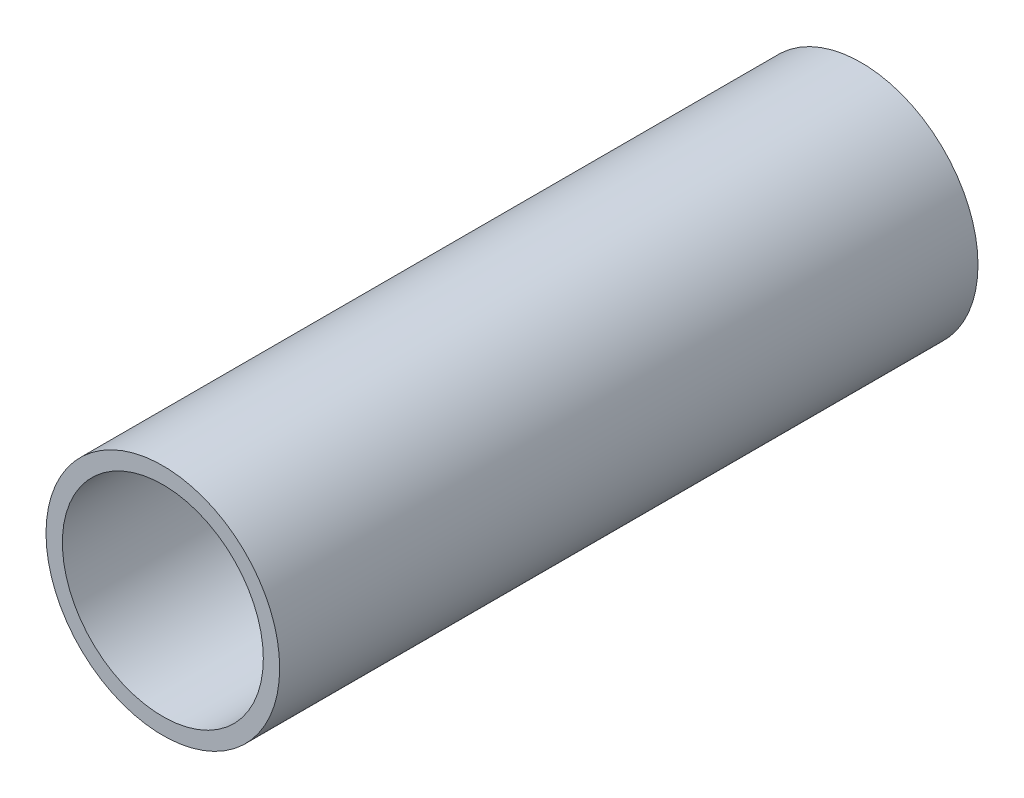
ISO-10303-21;
HEADER;
FILE_DESCRIPTION(('STEP AP214'),'2;1');
FILE_NAME('part.step','',(''),(''),'','','');
FILE_SCHEMA(('AUTOMOTIVE_DESIGN { 1 0 10303 214 1 1 1 1 }'));
ENDSEC;
DATA;
#1=APPLICATION_CONTEXT('core data for automotive mechanical design processes');
#2=APPLICATION_PROTOCOL_DEFINITION('international standard','automotive_design',2000,#1);
#3=PRODUCT_CONTEXT('',#1,'mechanical');
#4=PRODUCT('Part','Part','',(#3));
#5=PRODUCT_RELATED_PRODUCT_CATEGORY('part','',(#4));
#6=PRODUCT_DEFINITION_FORMATION('','',#4);
#7=PRODUCT_DEFINITION_CONTEXT('part definition',#1,'design');
#8=PRODUCT_DEFINITION('design','',#6,#7);
#9=PRODUCT_DEFINITION_SHAPE('','',#8);
#10=(LENGTH_UNIT() NAMED_UNIT(*) SI_UNIT(.MILLI.,.METRE.));
#11=(NAMED_UNIT(*) PLANE_ANGLE_UNIT() SI_UNIT($,.RADIAN.));
#12=(NAMED_UNIT(*) SI_UNIT($,.STERADIAN.) SOLID_ANGLE_UNIT());
#13=UNCERTAINTY_MEASURE_WITH_UNIT(LENGTH_MEASURE(1.E-05),#10,'distance_accuracy_value','');
#14=(GEOMETRIC_REPRESENTATION_CONTEXT(3) GLOBAL_UNCERTAINTY_ASSIGNED_CONTEXT((#13)) GLOBAL_UNIT_ASSIGNED_CONTEXT((#10,
#11,#12)) REPRESENTATION_CONTEXT('',''));
#15=CARTESIAN_POINT('',(0.,0.,0.));
#16=DIRECTION('',(0.,0.,1.));
#17=DIRECTION('',(1.,0.,0.));
#18=AXIS2_PLACEMENT_3D('',#15,#16,#17);
#19=CARTESIAN_POINT('',(0.,0.,50.8));
#20=DIRECTION('',(0.,0.,1.));
#21=DIRECTION('',(1.,0.,0.));
#22=AXIS2_PLACEMENT_3D('',#19,#20,#21);
#23=PLANE('',#22);
#24=CARTESIAN_POINT('',(0.,0.,50.8));
#25=DIRECTION('',(0.,0.,1.));
#26=DIRECTION('',(1.,0.,0.));
#27=AXIS2_PLACEMENT_3D('',#24,#25,#26);
#28=CIRCLE('',#27,8.5);
#29=CARTESIAN_POINT('',(8.5,0.,50.8));
#30=VERTEX_POINT('',#29);
#31=EDGE_CURVE('E10',#30,#30,#28,.T.);
#32=ORIENTED_EDGE('',*,*,#31,.T.);
#33=EDGE_LOOP('',(#32));
#34=FACE_BOUND('',#33,.T.);
#35=CARTESIAN_POINT('',(0.,0.,50.8));
#36=DIRECTION('',(0.,0.,1.));
#37=DIRECTION('',(1.,0.,0.));
#38=AXIS2_PLACEMENT_3D('',#35,#36,#37);
#39=CIRCLE('',#38,7.309375);
#40=CARTESIAN_POINT('',(7.309375,0.,50.8));
#41=VERTEX_POINT('',#40);
#42=EDGE_CURVE('E42',#41,#41,#39,.T.);
#43=ORIENTED_EDGE('',*,*,#42,.F.);
#44=EDGE_LOOP('',(#43));
#45=FACE_BOUND('',#44,.T.);
#46=ADVANCED_FACE('F31',(#34,#45),#23,.T.);
#47=CARTESIAN_POINT('',(0.,0.,0.));
#48=DIRECTION('',(0.,0.,1.));
#49=DIRECTION('',(1.,0.,0.));
#50=AXIS2_PLACEMENT_3D('',#47,#48,#49);
#51=PLANE('',#50);
#52=CARTESIAN_POINT('',(0.,0.,0.));
#53=DIRECTION('',(0.,0.,1.));
#54=DIRECTION('',(1.,0.,0.));
#55=AXIS2_PLACEMENT_3D('',#52,#53,#54);
#56=CIRCLE('',#55,8.5);
#57=CARTESIAN_POINT('',(8.5,0.,0.));
#58=VERTEX_POINT('',#57);
#59=EDGE_CURVE('E35',#58,#58,#56,.T.);
#60=ORIENTED_EDGE('',*,*,#59,.F.);
#61=EDGE_LOOP('',(#60));
#62=FACE_BOUND('',#61,.T.);
#63=CARTESIAN_POINT('',(0.,0.,0.));
#64=DIRECTION('',(0.,0.,1.));
#65=DIRECTION('',(1.,0.,0.));
#66=AXIS2_PLACEMENT_3D('',#63,#64,#65);
#67=CIRCLE('',#66,7.309375);
#68=CARTESIAN_POINT('',(7.309375,0.,0.));
#69=VERTEX_POINT('',#68);
#70=EDGE_CURVE('E44',#69,#69,#67,.T.);
#71=ORIENTED_EDGE('',*,*,#70,.T.);
#72=EDGE_LOOP('',(#71));
#73=FACE_BOUND('',#72,.T.);
#74=ADVANCED_FACE('F54',(#62,#73),#51,.F.);
#75=CARTESIAN_POINT('',(0.,0.,50.8));
#76=DIRECTION('',(0.,0.,-1.));
#77=DIRECTION('',(-1.,0.,0.));
#78=AXIS2_PLACEMENT_3D('',#75,#76,#77);
#79=CYLINDRICAL_SURFACE('',#78,8.5);
#80=ORIENTED_EDGE('',*,*,#31,.F.);
#81=EDGE_LOOP('',(#80));
#82=FACE_BOUND('',#81,.T.);
#83=ORIENTED_EDGE('',*,*,#59,.T.);
#84=EDGE_LOOP('',(#83));
#85=FACE_BOUND('',#84,.T.);
#86=ADVANCED_FACE('F33',(#82,#85),#79,.T.);
#87=CARTESIAN_POINT('',(0.,0.,50.8));
#88=DIRECTION('',(0.,0.,-1.));
#89=DIRECTION('',(-1.,0.,0.));
#90=AXIS2_PLACEMENT_3D('',#87,#88,#89);
#91=CYLINDRICAL_SURFACE('',#90,7.309375);
#92=ORIENTED_EDGE('',*,*,#42,.T.);
#93=EDGE_LOOP('',(#92));
#94=FACE_BOUND('',#93,.T.);
#95=ORIENTED_EDGE('',*,*,#70,.F.);
#96=EDGE_LOOP('',(#95));
#97=FACE_BOUND('',#96,.T.);
#98=ADVANCED_FACE('F50',(#94,#97),#91,.F.);
#99=CLOSED_SHELL('',(#46,#74,#86,#98));
#100=MANIFOLD_SOLID_BREP('B2',#99);
#101=ADVANCED_BREP_SHAPE_REPRESENTATION('',(#18,#100),#14);
#102=SHAPE_DEFINITION_REPRESENTATION(#9,#101);
ENDSEC;
END-ISO-10303-21;
